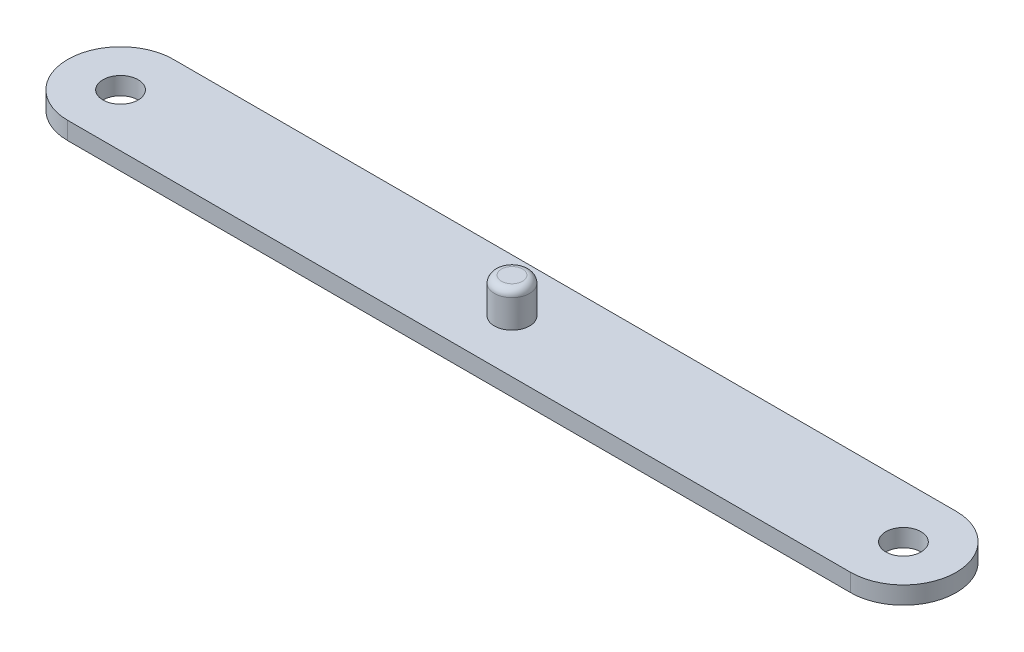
ISO-10303-21;
HEADER;
FILE_DESCRIPTION(('STEP AP214'),'2;1');
FILE_NAME('part.step','',(''),(''),'','','');
FILE_SCHEMA(('AUTOMOTIVE_DESIGN { 1 0 10303 214 1 1 1 1 }'));
ENDSEC;
DATA;
#1=APPLICATION_CONTEXT('core data for automotive mechanical design processes');
#2=APPLICATION_PROTOCOL_DEFINITION('international standard','automotive_design',2000,#1);
#3=PRODUCT_CONTEXT('',#1,'mechanical');
#4=PRODUCT('Part','Part','',(#3));
#5=PRODUCT_RELATED_PRODUCT_CATEGORY('part','',(#4));
#6=PRODUCT_DEFINITION_FORMATION('','',#4);
#7=PRODUCT_DEFINITION_CONTEXT('part definition',#1,'design');
#8=PRODUCT_DEFINITION('design','',#6,#7);
#9=PRODUCT_DEFINITION_SHAPE('','',#8);
#10=(LENGTH_UNIT() NAMED_UNIT(*) SI_UNIT(.MILLI.,.METRE.));
#11=(NAMED_UNIT(*) PLANE_ANGLE_UNIT() SI_UNIT($,.RADIAN.));
#12=(NAMED_UNIT(*) SI_UNIT($,.STERADIAN.) SOLID_ANGLE_UNIT());
#13=UNCERTAINTY_MEASURE_WITH_UNIT(LENGTH_MEASURE(1.E-05),#10,'distance_accuracy_value','');
#14=(GEOMETRIC_REPRESENTATION_CONTEXT(3) GLOBAL_UNCERTAINTY_ASSIGNED_CONTEXT((#13)) GLOBAL_UNIT_ASSIGNED_CONTEXT((#10,
#11,#12)) REPRESENTATION_CONTEXT('',''));
#15=CARTESIAN_POINT('',(0.,0.,0.));
#16=DIRECTION('',(0.,0.,1.));
#17=DIRECTION('',(1.,0.,0.));
#18=AXIS2_PLACEMENT_3D('',#15,#16,#17);
#19=CARTESIAN_POINT('',(141.1605,3.175,0.));
#20=DIRECTION('',(0.,-1.,0.));
#21=DIRECTION('',(0.,0.,-1.));
#22=AXIS2_PLACEMENT_3D('',#19,#20,#21);
#23=PLANE('',#22);
#24=CARTESIAN_POINT('',(141.1605,3.175,0.));
#25=DIRECTION('',(0.,1.,0.));
#26=DIRECTION('',(0.,0.,-1.));
#27=AXIS2_PLACEMENT_3D('',#24,#25,#26);
#28=CIRCLE('',#27,19.05);
#29=CARTESIAN_POINT('',(141.1605,3.175,19.05));
#30=VERTEX_POINT('',#29);
#31=CARTESIAN_POINT('',(141.1605,3.175,-19.05));
#32=VERTEX_POINT('',#31);
#33=EDGE_CURVE('E88',#30,#32,#28,.T.);
#34=ORIENTED_EDGE('',*,*,#33,.T.);
#35=DIRECTION('',(-1.,0.,0.));
#36=VECTOR('',#35,1.);
#37=CARTESIAN_POINT('',(-141.1605,3.175,-19.05));
#38=LINE('',#37,#36);
#39=CARTESIAN_POINT('',(-141.1605,3.175,-19.05));
#40=VERTEX_POINT('',#39);
#41=EDGE_CURVE('E83',#32,#40,#38,.T.);
#42=ORIENTED_EDGE('',*,*,#41,.T.);
#43=CARTESIAN_POINT('',(-141.1605,3.175,0.));
#44=DIRECTION('',(0.,1.,0.));
#45=DIRECTION('',(0.,0.,1.));
#46=AXIS2_PLACEMENT_3D('',#43,#44,#45);
#47=CIRCLE('',#46,19.05);
#48=CARTESIAN_POINT('',(-141.1605,3.175,19.05));
#49=VERTEX_POINT('',#48);
#50=EDGE_CURVE('E86',#40,#49,#47,.T.);
#51=ORIENTED_EDGE('',*,*,#50,.T.);
#52=DIRECTION('',(1.,0.,0.));
#53=VECTOR('',#52,1.);
#54=CARTESIAN_POINT('',(-141.1605,3.175,19.05));
#55=LINE('',#54,#53);
#56=EDGE_CURVE('E52',#49,#30,#55,.T.);
#57=ORIENTED_EDGE('',*,*,#56,.T.);
#58=EDGE_LOOP('',(#34,#42,#51,#57));
#59=FACE_BOUND('',#58,.T.);
#60=CARTESIAN_POINT('',(-141.1605,3.175,0.));
#61=DIRECTION('',(0.,1.,0.));
#62=DIRECTION('',(0.,0.,1.));
#63=AXIS2_PLACEMENT_3D('',#60,#61,#62);
#64=CIRCLE('',#63,6.35);
#65=CARTESIAN_POINT('',(-141.1605,3.175,6.34999999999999));
#66=VERTEX_POINT('',#65);
#67=EDGE_CURVE('E231',#66,#66,#64,.T.);
#68=ORIENTED_EDGE('',*,*,#67,.F.);
#69=EDGE_LOOP('',(#68));
#70=FACE_BOUND('',#69,.T.);
#71=CARTESIAN_POINT('',(141.1605,3.175,0.));
#72=DIRECTION('',(0.,1.,0.));
#73=DIRECTION('',(0.,0.,-1.));
#74=AXIS2_PLACEMENT_3D('',#71,#72,#73);
#75=CIRCLE('',#74,6.35);
#76=CARTESIAN_POINT('',(141.1605,3.175,-6.35));
#77=VERTEX_POINT('',#76);
#78=EDGE_CURVE('E228',#77,#77,#75,.T.);
#79=ORIENTED_EDGE('',*,*,#78,.F.);
#80=EDGE_LOOP('',(#79));
#81=FACE_BOUND('',#80,.T.);
#82=CARTESIAN_POINT('',(0.,3.175,0.));
#83=DIRECTION('',(0.,-1.,0.));
#84=DIRECTION('',(0.,0.,-1.));
#85=AXIS2_PLACEMENT_3D('',#82,#83,#84);
#86=CIRCLE('',#85,6.35);
#87=CARTESIAN_POINT('',(0.,3.175,-6.35));
#88=VERTEX_POINT('',#87);
#89=EDGE_CURVE('E113',#88,#88,#86,.F.);
#90=ORIENTED_EDGE('',*,*,#89,.F.);
#91=EDGE_LOOP('',(#90));
#92=FACE_BOUND('',#91,.T.);
#93=ADVANCED_FACE('F35',(#59,#70,#81,#92),#23,.F.);
#94=CARTESIAN_POINT('',(141.1605,3.175,0.));
#95=DIRECTION('',(0.,-1.,0.));
#96=DIRECTION('',(0.,0.,-1.));
#97=AXIS2_PLACEMENT_3D('',#94,#95,#96);
#98=CYLINDRICAL_SURFACE('',#97,19.05);
#99=CARTESIAN_POINT('',(141.1605,-3.175,0.));
#100=DIRECTION('',(0.,1.,0.));
#101=DIRECTION('',(0.,0.,-1.));
#102=AXIS2_PLACEMENT_3D('',#99,#100,#101);
#103=CIRCLE('',#102,19.05);
#104=CARTESIAN_POINT('',(141.1605,-3.175,19.05));
#105=VERTEX_POINT('',#104);
#106=CARTESIAN_POINT('',(141.1605,-3.175,-19.05));
#107=VERTEX_POINT('',#106);
#108=EDGE_CURVE('E103',#105,#107,#103,.T.);
#109=ORIENTED_EDGE('',*,*,#108,.T.);
#110=DIRECTION('',(0.,-1.,0.));
#111=VECTOR('',#110,1.);
#112=CARTESIAN_POINT('',(141.1605,3.175,-19.05));
#113=LINE('',#112,#111);
#114=EDGE_CURVE('E94',#32,#107,#113,.T.);
#115=ORIENTED_EDGE('',*,*,#114,.F.);
#116=ORIENTED_EDGE('',*,*,#33,.F.);
#117=DIRECTION('',(0.,-1.,0.));
#118=VECTOR('',#117,1.);
#119=CARTESIAN_POINT('',(141.1605,3.175,19.05));
#120=LINE('',#119,#118);
#121=EDGE_CURVE('E99',#30,#105,#120,.T.);
#122=ORIENTED_EDGE('',*,*,#121,.T.);
#123=EDGE_LOOP('',(#109,#115,#116,#122));
#124=FACE_BOUND('',#123,.T.);
#125=ADVANCED_FACE('F129',(#124),#98,.T.);
#126=CARTESIAN_POINT('',(-141.1605,3.175,-19.05));
#127=DIRECTION('',(0.,0.,1.));
#128=DIRECTION('',(1.,0.,0.));
#129=AXIS2_PLACEMENT_3D('',#126,#127,#128);
#130=PLANE('',#129);
#131=DIRECTION('',(-1.,0.,0.));
#132=VECTOR('',#131,1.);
#133=CARTESIAN_POINT('',(-141.1605,-3.175,-19.05));
#134=LINE('',#133,#132);
#135=CARTESIAN_POINT('',(-141.1605,-3.175,-19.05));
#136=VERTEX_POINT('',#135);
#137=EDGE_CURVE('E93',#107,#136,#134,.T.);
#138=ORIENTED_EDGE('',*,*,#137,.T.);
#139=DIRECTION('',(0.,-1.,0.));
#140=VECTOR('',#139,1.);
#141=CARTESIAN_POINT('',(-141.1605,3.175,-19.05));
#142=LINE('',#141,#140);
#143=EDGE_CURVE('E91',#40,#136,#142,.T.);
#144=ORIENTED_EDGE('',*,*,#143,.F.);
#145=ORIENTED_EDGE('',*,*,#41,.F.);
#146=ORIENTED_EDGE('',*,*,#114,.T.);
#147=EDGE_LOOP('',(#138,#144,#145,#146));
#148=FACE_BOUND('',#147,.T.);
#149=ADVANCED_FACE('F92',(#148),#130,.F.);
#150=CARTESIAN_POINT('',(-141.1605,3.175,0.));
#151=DIRECTION('',(0.,-1.,0.));
#152=DIRECTION('',(0.,0.,-1.));
#153=AXIS2_PLACEMENT_3D('',#150,#151,#152);
#154=CYLINDRICAL_SURFACE('',#153,19.05);
#155=CARTESIAN_POINT('',(-141.1605,-3.175,0.));
#156=DIRECTION('',(0.,1.,0.));
#157=DIRECTION('',(0.,0.,1.));
#158=AXIS2_PLACEMENT_3D('',#155,#156,#157);
#159=CIRCLE('',#158,19.05);
#160=CARTESIAN_POINT('',(-141.1605,-3.175,19.05));
#161=VERTEX_POINT('',#160);
#162=EDGE_CURVE('E69',#136,#161,#159,.T.);
#163=ORIENTED_EDGE('',*,*,#162,.T.);
#164=DIRECTION('',(0.,-1.,0.));
#165=VECTOR('',#164,1.);
#166=CARTESIAN_POINT('',(-141.1605,3.175,19.05));
#167=LINE('',#166,#165);
#168=EDGE_CURVE('E95',#49,#161,#167,.T.);
#169=ORIENTED_EDGE('',*,*,#168,.F.);
#170=ORIENTED_EDGE('',*,*,#50,.F.);
#171=ORIENTED_EDGE('',*,*,#143,.T.);
#172=EDGE_LOOP('',(#163,#169,#170,#171));
#173=FACE_BOUND('',#172,.T.);
#174=ADVANCED_FACE('F97',(#173),#154,.T.);
#175=CARTESIAN_POINT('',(-141.1605,3.175,19.05));
#176=DIRECTION('',(0.,0.,-1.));
#177=DIRECTION('',(-1.,0.,0.));
#178=AXIS2_PLACEMENT_3D('',#175,#176,#177);
#179=PLANE('',#178);
#180=DIRECTION('',(1.,0.,0.));
#181=VECTOR('',#180,1.);
#182=CARTESIAN_POINT('',(-141.1605,-3.175,19.05));
#183=LINE('',#182,#181);
#184=EDGE_CURVE('E75',#161,#105,#183,.T.);
#185=ORIENTED_EDGE('',*,*,#184,.T.);
#186=ORIENTED_EDGE('',*,*,#121,.F.);
#187=ORIENTED_EDGE('',*,*,#56,.F.);
#188=ORIENTED_EDGE('',*,*,#168,.T.);
#189=EDGE_LOOP('',(#185,#186,#187,#188));
#190=FACE_BOUND('',#189,.T.);
#191=ADVANCED_FACE('F142',(#190),#179,.F.);
#192=CARTESIAN_POINT('',(141.1605,-3.175,0.));
#193=DIRECTION('',(0.,-1.,0.));
#194=DIRECTION('',(0.,0.,-1.));
#195=AXIS2_PLACEMENT_3D('',#192,#193,#194);
#196=PLANE('',#195);
#197=CARTESIAN_POINT('',(141.1605,-3.175,0.));
#198=DIRECTION('',(0.,1.,0.));
#199=DIRECTION('',(0.,0.,-1.));
#200=AXIS2_PLACEMENT_3D('',#197,#198,#199);
#201=CIRCLE('',#200,6.35);
#202=CARTESIAN_POINT('',(141.1605,-3.175,-6.35));
#203=VERTEX_POINT('',#202);
#204=EDGE_CURVE('E225',#203,#203,#201,.T.);
#205=ORIENTED_EDGE('',*,*,#204,.T.);
#206=EDGE_LOOP('',(#205));
#207=FACE_BOUND('',#206,.T.);
#208=CARTESIAN_POINT('',(-141.1605,-3.175,0.));
#209=DIRECTION('',(0.,1.,0.));
#210=DIRECTION('',(0.,0.,1.));
#211=AXIS2_PLACEMENT_3D('',#208,#209,#210);
#212=CIRCLE('',#211,6.35);
#213=CARTESIAN_POINT('',(-141.1605,-3.175,6.34999999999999));
#214=VERTEX_POINT('',#213);
#215=EDGE_CURVE('E106',#214,#214,#212,.T.);
#216=ORIENTED_EDGE('',*,*,#215,.T.);
#217=EDGE_LOOP('',(#216));
#218=FACE_BOUND('',#217,.T.);
#219=ORIENTED_EDGE('',*,*,#108,.F.);
#220=ORIENTED_EDGE('',*,*,#184,.F.);
#221=ORIENTED_EDGE('',*,*,#162,.F.);
#222=ORIENTED_EDGE('',*,*,#137,.F.);
#223=EDGE_LOOP('',(#219,#220,#221,#222));
#224=FACE_BOUND('',#223,.T.);
#225=ADVANCED_FACE('F139',(#207,#218,#224),#196,.T.);
#226=CARTESIAN_POINT('',(-141.1605,-3.175,0.));
#227=DIRECTION('',(0.,1.,0.));
#228=DIRECTION('',(0.,0.,1.));
#229=AXIS2_PLACEMENT_3D('',#226,#227,#228);
#230=CYLINDRICAL_SURFACE('',#229,6.35);
#231=ORIENTED_EDGE('',*,*,#215,.F.);
#232=EDGE_LOOP('',(#231));
#233=FACE_BOUND('',#232,.T.);
#234=ORIENTED_EDGE('',*,*,#67,.T.);
#235=EDGE_LOOP('',(#234));
#236=FACE_BOUND('',#235,.T.);
#237=ADVANCED_FACE('F137',(#233,#236),#230,.F.);
#238=CARTESIAN_POINT('',(141.1605,-3.175,0.));
#239=DIRECTION('',(0.,1.,0.));
#240=DIRECTION('',(0.,0.,1.));
#241=AXIS2_PLACEMENT_3D('',#238,#239,#240);
#242=CYLINDRICAL_SURFACE('',#241,6.35);
#243=ORIENTED_EDGE('',*,*,#204,.F.);
#244=EDGE_LOOP('',(#243));
#245=FACE_BOUND('',#244,.T.);
#246=ORIENTED_EDGE('',*,*,#78,.T.);
#247=EDGE_LOOP('',(#246));
#248=FACE_BOUND('',#247,.T.);
#249=ADVANCED_FACE('F171',(#245,#248),#242,.F.);
#250=CARTESIAN_POINT('',(0.,15.875,0.));
#251=DIRECTION('',(0.,-1.,0.));
#252=DIRECTION('',(0.,0.,-1.));
#253=AXIS2_PLACEMENT_3D('',#250,#251,#252);
#254=CYLINDRICAL_SURFACE('',#253,6.35);
#255=CARTESIAN_POINT('',(0.,13.335,0.));
#256=DIRECTION('',(0.,1.,0.));
#257=DIRECTION('',(0.,0.,1.));
#258=AXIS2_PLACEMENT_3D('',#255,#256,#257);
#259=CIRCLE('',#258,6.35);
#260=CARTESIAN_POINT('',(0.,13.335,6.35));
#261=VERTEX_POINT('',#260);
#262=EDGE_CURVE('E11',#261,#261,#259,.F.);
#263=ORIENTED_EDGE('',*,*,#262,.T.);
#264=EDGE_LOOP('',(#263));
#265=FACE_BOUND('',#264,.T.);
#266=ORIENTED_EDGE('',*,*,#89,.T.);
#267=EDGE_LOOP('',(#266));
#268=FACE_BOUND('',#267,.T.);
#269=ADVANCED_FACE('F125',(#265,#268),#254,.T.);
#270=CARTESIAN_POINT('',(0.,15.875,0.));
#271=DIRECTION('',(0.,1.,0.));
#272=DIRECTION('',(0.,0.,1.));
#273=AXIS2_PLACEMENT_3D('',#270,#271,#272);
#274=PLANE('',#273);
#275=CARTESIAN_POINT('',(0.,15.875,0.));
#276=DIRECTION('',(0.,1.,0.));
#277=DIRECTION('',(0.,0.,1.));
#278=AXIS2_PLACEMENT_3D('',#275,#276,#277);
#279=CIRCLE('',#278,3.81);
#280=CARTESIAN_POINT('',(0.,15.875,3.81));
#281=VERTEX_POINT('',#280);
#282=EDGE_CURVE('E44',#281,#281,#279,.T.);
#283=ORIENTED_EDGE('',*,*,#282,.T.);
#284=EDGE_LOOP('',(#283));
#285=FACE_BOUND('',#284,.T.);
#286=ADVANCED_FACE('F118',(#285),#274,.T.);
#287=CARTESIAN_POINT('',(0.,13.335,0.));
#288=DIRECTION('',(0.,1.,0.));
#289=DIRECTION('',(0.,0.,1.));
#290=AXIS2_PLACEMENT_3D('',#287,#288,#289);
#291=TOROIDAL_SURFACE('',#290,3.81,2.54);
#292=ORIENTED_EDGE('',*,*,#262,.F.);
#293=EDGE_LOOP('',(#292));
#294=FACE_BOUND('',#293,.T.);
#295=ORIENTED_EDGE('',*,*,#282,.F.);
#296=EDGE_LOOP('',(#295));
#297=FACE_BOUND('',#296,.T.);
#298=ADVANCED_FACE('F37',(#294,#297),#291,.T.);
#299=CLOSED_SHELL('',(#93,#125,#149,#174,#191,#225,#237,#249,#269,#286,#298));
#300=MANIFOLD_SOLID_BREP('B2',#299);
#301=ADVANCED_BREP_SHAPE_REPRESENTATION('',(#18,#300),#14);
#302=SHAPE_DEFINITION_REPRESENTATION(#9,#301);
ENDSEC;
END-ISO-10303-21;
